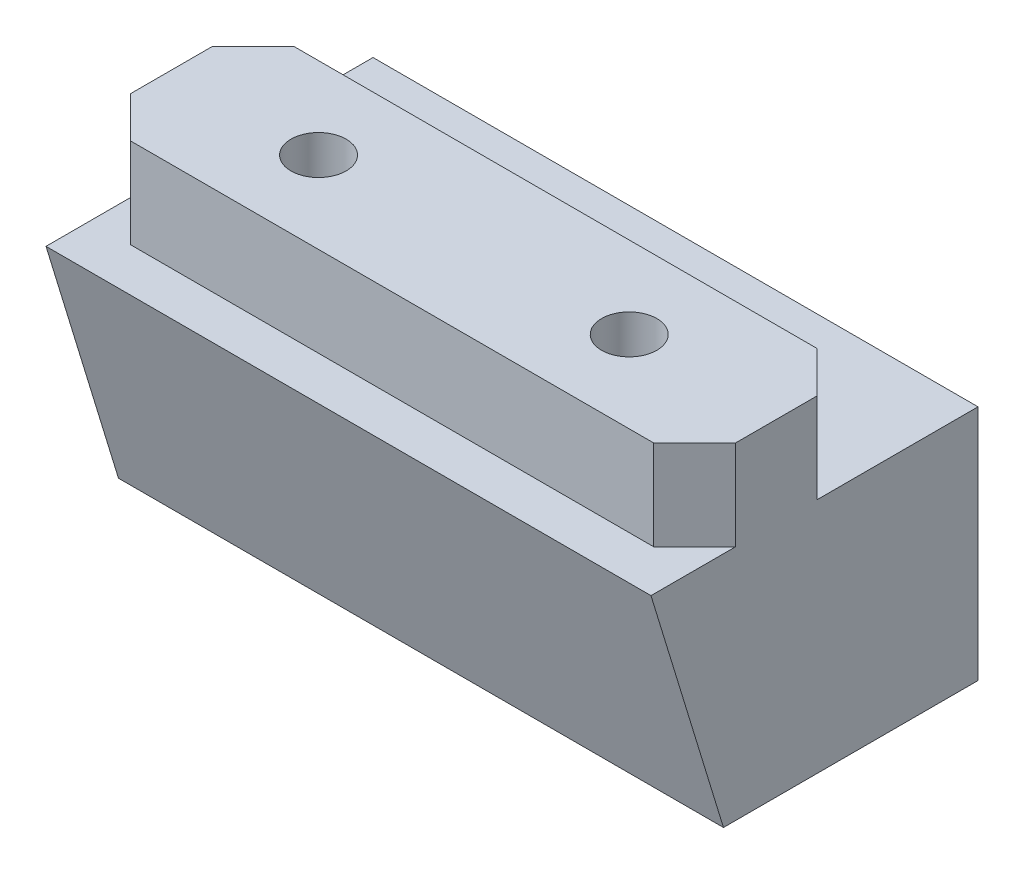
ISO-10303-21;
HEADER;
FILE_DESCRIPTION(('STEP AP214'),'2;1');
FILE_NAME('part.step','',(''),(''),'','','');
FILE_SCHEMA(('AUTOMOTIVE_DESIGN { 1 0 10303 214 1 1 1 1 }'));
ENDSEC;
DATA;
#1=APPLICATION_CONTEXT('core data for automotive mechanical design processes');
#2=APPLICATION_PROTOCOL_DEFINITION('international standard','automotive_design',2000,#1);
#3=PRODUCT_CONTEXT('',#1,'mechanical');
#4=PRODUCT('Part','Part','',(#3));
#5=PRODUCT_RELATED_PRODUCT_CATEGORY('part','',(#4));
#6=PRODUCT_DEFINITION_FORMATION('','',#4);
#7=PRODUCT_DEFINITION_CONTEXT('part definition',#1,'design');
#8=PRODUCT_DEFINITION('design','',#6,#7);
#9=PRODUCT_DEFINITION_SHAPE('','',#8);
#10=(LENGTH_UNIT() NAMED_UNIT(*) SI_UNIT(.MILLI.,.METRE.));
#11=(NAMED_UNIT(*) PLANE_ANGLE_UNIT() SI_UNIT($,.RADIAN.));
#12=(NAMED_UNIT(*) SI_UNIT($,.STERADIAN.) SOLID_ANGLE_UNIT());
#13=UNCERTAINTY_MEASURE_WITH_UNIT(LENGTH_MEASURE(1.E-05),#10,'distance_accuracy_value','');
#14=(GEOMETRIC_REPRESENTATION_CONTEXT(3) GLOBAL_UNCERTAINTY_ASSIGNED_CONTEXT((#13)) GLOBAL_UNIT_ASSIGNED_CONTEXT((#10,
#11,#12)) REPRESENTATION_CONTEXT('',''));
#15=CARTESIAN_POINT('',(0.,0.,0.));
#16=DIRECTION('',(0.,0.,1.));
#17=DIRECTION('',(1.,0.,0.));
#18=AXIS2_PLACEMENT_3D('',#15,#16,#17);
#19=CARTESIAN_POINT('',(37.,14.,-88.));
#20=DIRECTION('',(0.,1.,0.));
#21=DIRECTION('',(0.,0.,-1.));
#22=AXIS2_PLACEMENT_3D('',#19,#20,#21);
#23=PLANE('',#22);
#24=DIRECTION('',(0.,0.,-1.));
#25=VECTOR('',#24,1.);
#26=CARTESIAN_POINT('',(-37.,14.,-87.662689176));
#27=LINE('',#26,#25);
#28=CARTESIAN_POINT('',(-37.,14.,-88.000000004));
#29=VERTEX_POINT('',#28);
#30=CARTESIAN_POINT('',(-37.,14.,-107.662689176));
#31=VERTEX_POINT('',#30);
#32=EDGE_CURVE('E202',#29,#31,#27,.T.);
#33=ORIENTED_EDGE('',*,*,#32,.F.);
#34=DIRECTION('',(-0.707106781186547,0.,0.707106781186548));
#35=VECTOR('',#34,1.);
#36=CARTESIAN_POINT('',(-34.5,14.,-90.5));
#37=LINE('',#36,#35);
#38=CARTESIAN_POINT('',(-31.999999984,14.,-93.0000000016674));
#39=VERTEX_POINT('',#38);
#40=EDGE_CURVE('E192',#39,#29,#37,.T.);
#41=ORIENTED_EDGE('',*,*,#40,.F.);
#42=DIRECTION('',(1.,0.,0.));
#43=VECTOR('',#42,1.);
#44=CARTESIAN_POINT('',(0.,14.,-93.));
#45=LINE('',#44,#43);
#46=CARTESIAN_POINT('',(31.999999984,14.,-93.0000000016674));
#47=VERTEX_POINT('',#46);
#48=EDGE_CURVE('E188',#39,#47,#45,.T.);
#49=ORIENTED_EDGE('',*,*,#48,.T.);
#50=DIRECTION('',(-0.707106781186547,0.,-0.707106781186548));
#51=VECTOR('',#50,1.);
#52=CARTESIAN_POINT('',(34.5,14.,-90.5));
#53=LINE('',#52,#51);
#54=CARTESIAN_POINT('',(37.,14.,-88.000000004));
#55=VERTEX_POINT('',#54);
#56=EDGE_CURVE('E155',#55,#47,#53,.T.);
#57=ORIENTED_EDGE('',*,*,#56,.F.);
#58=DIRECTION('',(0.,0.,1.));
#59=VECTOR('',#58,1.);
#60=CARTESIAN_POINT('',(37.,14.,-87.662689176));
#61=LINE('',#60,#59);
#62=CARTESIAN_POINT('',(37.,14.,-107.662689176));
#63=VERTEX_POINT('',#62);
#64=EDGE_CURVE('E134',#63,#55,#61,.T.);
#65=ORIENTED_EDGE('',*,*,#64,.F.);
#66=DIRECTION('',(1.,0.,0.));
#67=VECTOR('',#66,1.);
#68=CARTESIAN_POINT('',(0.,14.,-107.662689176));
#69=LINE('',#68,#67);
#70=EDGE_CURVE('E93',#31,#63,#69,.T.);
#71=ORIENTED_EDGE('',*,*,#70,.F.);
#72=EDGE_LOOP('',(#33,#41,#49,#57,#65,#71));
#73=FACE_BOUND('',#72,.T.);
#74=ADVANCED_FACE('F24',(#73),#23,.T.);
#75=CARTESIAN_POINT('',(-37.,14.,-107.662689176));
#76=DIRECTION('',(0.,0.,-1.));
#77=DIRECTION('',(1.,0.,0.));
#78=AXIS2_PLACEMENT_3D('',#75,#76,#77);
#79=PLANE('',#78);
#80=ORIENTED_EDGE('',*,*,#70,.T.);
#81=DIRECTION('',(0.,1.,0.));
#82=VECTOR('',#81,1.);
#83=CARTESIAN_POINT('',(37.,5.,-107.662689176));
#84=LINE('',#83,#82);
#85=CARTESIAN_POINT('',(37.,-15.,-107.662689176));
#86=VERTEX_POINT('',#85);
#87=EDGE_CURVE('E151',#86,#63,#84,.T.);
#88=ORIENTED_EDGE('',*,*,#87,.F.);
#89=DIRECTION('',(-1.,0.,0.));
#90=VECTOR('',#89,1.);
#91=CARTESIAN_POINT('',(0.,-15.,-107.662689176));
#92=LINE('',#91,#90);
#93=CARTESIAN_POINT('',(-37.,-15.,-107.662689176));
#94=VERTEX_POINT('',#93);
#95=EDGE_CURVE('E141',#86,#94,#92,.T.);
#96=ORIENTED_EDGE('',*,*,#95,.T.);
#97=DIRECTION('',(0.,-1.,0.));
#98=VECTOR('',#97,1.);
#99=CARTESIAN_POINT('',(-37.,5.,-107.662689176));
#100=LINE('',#99,#98);
#101=EDGE_CURVE('E174',#31,#94,#100,.T.);
#102=ORIENTED_EDGE('',*,*,#101,.F.);
#103=EDGE_LOOP('',(#80,#88,#96,#102));
#104=FACE_BOUND('',#103,.T.);
#105=ADVANCED_FACE('F154',(#104),#79,.T.);
#106=CARTESIAN_POINT('',(37.,-15.,-76.528878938));
#107=DIRECTION('',(0.,1.,0.));
#108=DIRECTION('',(0.,0.,-1.));
#109=AXIS2_PLACEMENT_3D('',#106,#107,#108);
#110=PLANE('',#109);
#111=DIRECTION('',(0.,0.,-1.));
#112=VECTOR('',#111,1.);
#113=CARTESIAN_POINT('',(37.,-15.,-87.662689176));
#114=LINE('',#113,#112);
#115=CARTESIAN_POINT('',(37.,-15.,-76.528878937));
#116=VERTEX_POINT('',#115);
#117=EDGE_CURVE('E145',#116,#86,#114,.T.);
#118=ORIENTED_EDGE('',*,*,#117,.F.);
#119=DIRECTION('',(1.,0.,0.));
#120=VECTOR('',#119,1.);
#121=CARTESIAN_POINT('',(0.,-15.,-76.528878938));
#122=LINE('',#121,#120);
#123=CARTESIAN_POINT('',(-37.,-15.,-76.528878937));
#124=VERTEX_POINT('',#123);
#125=EDGE_CURVE('E147',#124,#116,#122,.T.);
#126=ORIENTED_EDGE('',*,*,#125,.F.);
#127=DIRECTION('',(0.,0.,1.));
#128=VECTOR('',#127,1.);
#129=CARTESIAN_POINT('',(-37.,-15.,-87.662689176));
#130=LINE('',#129,#128);
#131=EDGE_CURVE('E146',#94,#124,#130,.T.);
#132=ORIENTED_EDGE('',*,*,#131,.F.);
#133=ORIENTED_EDGE('',*,*,#95,.F.);
#134=EDGE_LOOP('',(#118,#126,#132,#133));
#135=FACE_BOUND('',#134,.T.);
#136=ADVANCED_FACE('F143',(#135),#110,.F.);
#137=CARTESIAN_POINT('',(37.,14.,-67.662689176));
#138=DIRECTION('',(0.,-0.292371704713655,0.956304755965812));
#139=DIRECTION('',(-1.,0.,0.));
#140=AXIS2_PLACEMENT_3D('',#137,#138,#139);
#141=PLANE('',#140);
#142=DIRECTION('',(0.,-0.956304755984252,-0.29237170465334));
#143=VECTOR('',#142,1.);
#144=CARTESIAN_POINT('',(37.,14.,-67.662689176));
#145=LINE('',#144,#143);
#146=CARTESIAN_POINT('',(37.,14.,-67.662689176));
#147=VERTEX_POINT('',#146);
#148=EDGE_CURVE('E28',#147,#116,#145,.T.);
#149=ORIENTED_EDGE('',*,*,#148,.F.);
#150=DIRECTION('',(1.,0.,0.));
#151=VECTOR('',#150,1.);
#152=CARTESIAN_POINT('',(0.,14.,-67.662689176));
#153=LINE('',#152,#151);
#154=CARTESIAN_POINT('',(-37.,14.,-67.662689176));
#155=VERTEX_POINT('',#154);
#156=EDGE_CURVE('E83',#155,#147,#153,.T.);
#157=ORIENTED_EDGE('',*,*,#156,.F.);
#158=DIRECTION('',(0.,0.956304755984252,0.29237170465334));
#159=VECTOR('',#158,1.);
#160=CARTESIAN_POINT('',(-37.,-15.,-76.528878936));
#161=LINE('',#160,#159);
#162=EDGE_CURVE('E173',#124,#155,#161,.T.);
#163=ORIENTED_EDGE('',*,*,#162,.F.);
#164=ORIENTED_EDGE('',*,*,#125,.T.);
#165=EDGE_LOOP('',(#149,#157,#163,#164));
#166=FACE_BOUND('',#165,.T.);
#167=ADVANCED_FACE('F222',(#166),#141,.T.);
#168=CARTESIAN_POINT('',(37.,14.,-67.662689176));
#169=DIRECTION('',(0.,1.,0.));
#170=DIRECTION('',(0.,0.,-1.));
#171=AXIS2_PLACEMENT_3D('',#168,#169,#170);
#172=PLANE('',#171);
#173=DIRECTION('',(0.707106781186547,0.,0.707106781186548));
#174=VECTOR('',#173,1.);
#175=CARTESIAN_POINT('',(-34.5,14.,-75.5));
#176=LINE('',#175,#174);
#177=CARTESIAN_POINT('',(-37.,14.,-78.000000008));
#178=VERTEX_POINT('',#177);
#179=CARTESIAN_POINT('',(-31.999999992,14.,-72.9999999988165));
#180=VERTEX_POINT('',#179);
#181=EDGE_CURVE('E207',#178,#180,#176,.T.);
#182=ORIENTED_EDGE('',*,*,#181,.F.);
#183=DIRECTION('',(0.,0.,-1.));
#184=VECTOR('',#183,1.);
#185=CARTESIAN_POINT('',(-37.,14.,-87.662689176));
#186=LINE('',#185,#184);
#187=EDGE_CURVE('E175',#155,#178,#186,.T.);
#188=ORIENTED_EDGE('',*,*,#187,.F.);
#189=ORIENTED_EDGE('',*,*,#156,.T.);
#190=DIRECTION('',(0.,0.,1.));
#191=VECTOR('',#190,1.);
#192=CARTESIAN_POINT('',(37.,14.,-87.662689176));
#193=LINE('',#192,#191);
#194=CARTESIAN_POINT('',(37.,14.,-78.000000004));
#195=VERTEX_POINT('',#194);
#196=EDGE_CURVE('E162',#195,#147,#193,.T.);
#197=ORIENTED_EDGE('',*,*,#196,.F.);
#198=DIRECTION('',(0.707106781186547,0.,-0.707106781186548));
#199=VECTOR('',#198,1.);
#200=CARTESIAN_POINT('',(34.5,14.,-75.5));
#201=LINE('',#200,#199);
#202=CARTESIAN_POINT('',(31.999999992,14.,-72.9999999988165));
#203=VERTEX_POINT('',#202);
#204=EDGE_CURVE('E107',#203,#195,#201,.T.);
#205=ORIENTED_EDGE('',*,*,#204,.F.);
#206=DIRECTION('',(-1.,0.,0.));
#207=VECTOR('',#206,1.);
#208=CARTESIAN_POINT('',(0.,14.,-73.));
#209=LINE('',#208,#207);
#210=EDGE_CURVE('E183',#203,#180,#209,.T.);
#211=ORIENTED_EDGE('',*,*,#210,.T.);
#212=EDGE_LOOP('',(#182,#188,#189,#197,#205,#211));
#213=FACE_BOUND('',#212,.T.);
#214=ADVANCED_FACE('F224',(#213),#172,.T.);
#215=CARTESIAN_POINT('',(-19.,-0.639156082,-83.));
#216=DIRECTION('',(0.,1.,0.));
#217=DIRECTION('',(0.,0.,1.));
#218=AXIS2_PLACEMENT_3D('',#215,#216,#217);
#219=CONICAL_SURFACE('',#218,0.,1.04719755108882);
#220=CARTESIAN_POINT('',(-19.,-0.639156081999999,-83.));
#221=VERTEX_POINT('',#220);
#222=VERTEX_LOOP('',#221);
#223=FACE_BOUND('',#222,.T.);
#224=CARTESIAN_POINT('',(-19.,1.30940107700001,-83.));
#225=DIRECTION('',(0.,1.,0.));
#226=DIRECTION('',(-1.,0.,0.));
#227=AXIS2_PLACEMENT_3D('',#224,#225,#226);
#228=CIRCLE('',#227,3.375);
#229=CARTESIAN_POINT('',(-22.375,1.309401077,-83.));
#230=VERTEX_POINT('',#229);
#231=EDGE_CURVE('E163',#230,#230,#228,.F.);
#232=ORIENTED_EDGE('',*,*,#231,.F.);
#233=EDGE_LOOP('',(#232));
#234=FACE_BOUND('',#233,.T.);
#235=ADVANCED_FACE('F286',(#223,#234),#219,.F.);
#236=CARTESIAN_POINT('',(37.,-15.,-107.662689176));
#237=DIRECTION('',(1.,0.,0.));
#238=DIRECTION('',(0.,1.,0.));
#239=AXIS2_PLACEMENT_3D('',#236,#237,#238);
#240=PLANE('',#239);
#241=ORIENTED_EDGE('',*,*,#117,.T.);
#242=ORIENTED_EDGE('',*,*,#87,.T.);
#243=ORIENTED_EDGE('',*,*,#64,.T.);
#244=DIRECTION('',(0.,-1.,0.));
#245=VECTOR('',#244,1.);
#246=CARTESIAN_POINT('',(37.,19.5,-88.));
#247=LINE('',#246,#245);
#248=CARTESIAN_POINT('',(37.,25.,-88.));
#249=VERTEX_POINT('',#248);
#250=EDGE_CURVE('E157',#249,#55,#247,.T.);
#251=ORIENTED_EDGE('',*,*,#250,.F.);
#252=DIRECTION('',(0.,0.,-1.));
#253=VECTOR('',#252,1.);
#254=CARTESIAN_POINT('',(37.,25.,-83.));
#255=LINE('',#254,#253);
#256=CARTESIAN_POINT('',(37.,25.,-78.));
#257=VERTEX_POINT('',#256);
#258=EDGE_CURVE('E165',#257,#249,#255,.T.);
#259=ORIENTED_EDGE('',*,*,#258,.F.);
#260=DIRECTION('',(0.,1.,0.));
#261=VECTOR('',#260,1.);
#262=CARTESIAN_POINT('',(37.,19.5,-78.));
#263=LINE('',#262,#261);
#264=EDGE_CURVE('E166',#195,#257,#263,.T.);
#265=ORIENTED_EDGE('',*,*,#264,.F.);
#266=ORIENTED_EDGE('',*,*,#196,.T.);
#267=ORIENTED_EDGE('',*,*,#148,.T.);
#268=EDGE_LOOP('',(#241,#242,#243,#251,#259,#265,#266,#267));
#269=FACE_BOUND('',#268,.T.);
#270=ADVANCED_FACE('F150',(#269),#240,.T.);
#271=CARTESIAN_POINT('',(37.,14.,-88.));
#272=DIRECTION('',(0.707106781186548,0.,-0.707106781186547));
#273=DIRECTION('',(-0.707106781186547,0.,-0.707106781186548));
#274=AXIS2_PLACEMENT_3D('',#271,#272,#273);
#275=PLANE('',#274);
#276=DIRECTION('',(-0.707106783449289,0.,-0.707106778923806));
#277=VECTOR('',#276,1.);
#278=CARTESIAN_POINT('',(37.,25.,-88.));
#279=LINE('',#278,#277);
#280=CARTESIAN_POINT('',(31.999999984,25.,-93.));
#281=VERTEX_POINT('',#280);
#282=EDGE_CURVE('E186',#249,#281,#279,.T.);
#283=ORIENTED_EDGE('',*,*,#282,.F.);
#284=ORIENTED_EDGE('',*,*,#250,.T.);
#285=ORIENTED_EDGE('',*,*,#56,.T.);
#286=DIRECTION('',(0.,1.,0.));
#287=VECTOR('',#286,1.);
#288=CARTESIAN_POINT('',(32.,19.5,-93.));
#289=LINE('',#288,#287);
#290=EDGE_CURVE('E189',#47,#281,#289,.T.);
#291=ORIENTED_EDGE('',*,*,#290,.T.);
#292=EDGE_LOOP('',(#283,#284,#285,#291));
#293=FACE_BOUND('',#292,.T.);
#294=ADVANCED_FACE('F252',(#293),#275,.T.);
#295=CARTESIAN_POINT('',(-32.,14.,-93.));
#296=DIRECTION('',(0.,0.,1.));
#297=DIRECTION('',(1.,0.,0.));
#298=AXIS2_PLACEMENT_3D('',#295,#296,#297);
#299=PLANE('',#298);
#300=ORIENTED_EDGE('',*,*,#290,.F.);
#301=ORIENTED_EDGE('',*,*,#48,.F.);
#302=DIRECTION('',(0.,-1.,0.));
#303=VECTOR('',#302,1.);
#304=CARTESIAN_POINT('',(-32.,19.5,-93.));
#305=LINE('',#304,#303);
#306=CARTESIAN_POINT('',(-31.999999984,25.,-93.));
#307=VERTEX_POINT('',#306);
#308=EDGE_CURVE('E196',#307,#39,#305,.T.);
#309=ORIENTED_EDGE('',*,*,#308,.F.);
#310=DIRECTION('',(-1.,0.,0.));
#311=VECTOR('',#310,1.);
#312=CARTESIAN_POINT('',(0.,25.,-93.));
#313=LINE('',#312,#311);
#314=EDGE_CURVE('E193',#281,#307,#313,.T.);
#315=ORIENTED_EDGE('',*,*,#314,.F.);
#316=EDGE_LOOP('',(#300,#301,#309,#315));
#317=FACE_BOUND('',#316,.T.);
#318=ADVANCED_FACE('F242',(#317),#299,.F.);
#319=CARTESIAN_POINT('',(-32.,14.,-93.));
#320=DIRECTION('',(-0.707106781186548,0.,-0.707106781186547));
#321=DIRECTION('',(-0.707106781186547,0.,0.707106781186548));
#322=AXIS2_PLACEMENT_3D('',#319,#320,#321);
#323=PLANE('',#322);
#324=DIRECTION('',(-0.707106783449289,0.,0.707106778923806));
#325=VECTOR('',#324,1.);
#326=CARTESIAN_POINT('',(-31.999999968,25.,-93.));
#327=LINE('',#326,#325);
#328=CARTESIAN_POINT('',(-37.,25.,-88.000000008));
#329=VERTEX_POINT('',#328);
#330=EDGE_CURVE('E195',#307,#329,#327,.T.);
#331=ORIENTED_EDGE('',*,*,#330,.F.);
#332=ORIENTED_EDGE('',*,*,#308,.T.);
#333=ORIENTED_EDGE('',*,*,#40,.T.);
#334=DIRECTION('',(0.,-1.,0.));
#335=VECTOR('',#334,1.);
#336=CARTESIAN_POINT('',(-37.,5.,-88.000000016));
#337=LINE('',#336,#335);
#338=EDGE_CURVE('E199',#329,#29,#337,.T.);
#339=ORIENTED_EDGE('',*,*,#338,.F.);
#340=EDGE_LOOP('',(#331,#332,#333,#339));
#341=FACE_BOUND('',#340,.T.);
#342=ADVANCED_FACE('F246',(#341),#323,.T.);
#343=CARTESIAN_POINT('',(-37.,25.,-107.662689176));
#344=DIRECTION('',(-1.,0.,0.));
#345=DIRECTION('',(0.,-1.,0.));
#346=AXIS2_PLACEMENT_3D('',#343,#344,#345);
#347=PLANE('',#346);
#348=ORIENTED_EDGE('',*,*,#187,.T.);
#349=DIRECTION('',(0.,-1.,0.));
#350=VECTOR('',#349,1.);
#351=CARTESIAN_POINT('',(-37.,19.5,-78.));
#352=LINE('',#351,#350);
#353=CARTESIAN_POINT('',(-37.,25.,-78.));
#354=VERTEX_POINT('',#353);
#355=EDGE_CURVE('E177',#354,#178,#352,.T.);
#356=ORIENTED_EDGE('',*,*,#355,.F.);
#357=DIRECTION('',(0.,0.,1.));
#358=VECTOR('',#357,1.);
#359=CARTESIAN_POINT('',(-37.,25.,-83.));
#360=LINE('',#359,#358);
#361=EDGE_CURVE('E203',#329,#354,#360,.T.);
#362=ORIENTED_EDGE('',*,*,#361,.F.);
#363=ORIENTED_EDGE('',*,*,#338,.T.);
#364=ORIENTED_EDGE('',*,*,#32,.T.);
#365=ORIENTED_EDGE('',*,*,#101,.T.);
#366=ORIENTED_EDGE('',*,*,#131,.T.);
#367=ORIENTED_EDGE('',*,*,#162,.T.);
#368=EDGE_LOOP('',(#348,#356,#362,#363,#364,#365,#366,#367));
#369=FACE_BOUND('',#368,.T.);
#370=ADVANCED_FACE('F219',(#369),#347,.T.);
#371=CARTESIAN_POINT('',(-32.,14.,-73.));
#372=DIRECTION('',(-0.707106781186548,0.,0.707106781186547));
#373=DIRECTION('',(0.,1.,0.));
#374=AXIS2_PLACEMENT_3D('',#371,#372,#373);
#375=PLANE('',#374);
#376=ORIENTED_EDGE('',*,*,#181,.T.);
#377=DIRECTION('',(0.,1.,0.));
#378=VECTOR('',#377,1.);
#379=CARTESIAN_POINT('',(-32.,19.5,-73.));
#380=LINE('',#379,#378);
#381=CARTESIAN_POINT('',(-31.999999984,25.,-73.));
#382=VERTEX_POINT('',#381);
#383=EDGE_CURVE('E208',#180,#382,#380,.T.);
#384=ORIENTED_EDGE('',*,*,#383,.T.);
#385=DIRECTION('',(0.70710678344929,0.,0.707106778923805));
#386=VECTOR('',#385,1.);
#387=CARTESIAN_POINT('',(-37.,25.,-78.));
#388=LINE('',#387,#386);
#389=EDGE_CURVE('E180',#354,#382,#388,.T.);
#390=ORIENTED_EDGE('',*,*,#389,.F.);
#391=ORIENTED_EDGE('',*,*,#355,.T.);
#392=EDGE_LOOP('',(#376,#384,#390,#391));
#393=FACE_BOUND('',#392,.T.);
#394=ADVANCED_FACE('F313',(#393),#375,.T.);
#395=CARTESIAN_POINT('',(32.,25.,-73.));
#396=DIRECTION('',(0.,0.,-1.));
#397=DIRECTION('',(0.,-1.,0.));
#398=AXIS2_PLACEMENT_3D('',#395,#396,#397);
#399=PLANE('',#398);
#400=DIRECTION('',(0.,-1.,0.));
#401=VECTOR('',#400,1.);
#402=CARTESIAN_POINT('',(32.,19.5,-73.));
#403=LINE('',#402,#401);
#404=CARTESIAN_POINT('',(31.999999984,25.,-73.));
#405=VERTEX_POINT('',#404);
#406=EDGE_CURVE('E181',#405,#203,#403,.T.);
#407=ORIENTED_EDGE('',*,*,#406,.F.);
#408=DIRECTION('',(1.,0.,0.));
#409=VECTOR('',#408,1.);
#410=CARTESIAN_POINT('',(0.,25.,-73.));
#411=LINE('',#410,#409);
#412=EDGE_CURVE('E43',#382,#405,#411,.T.);
#413=ORIENTED_EDGE('',*,*,#412,.F.);
#414=ORIENTED_EDGE('',*,*,#383,.F.);
#415=ORIENTED_EDGE('',*,*,#210,.F.);
#416=EDGE_LOOP('',(#407,#413,#414,#415));
#417=FACE_BOUND('',#416,.T.);
#418=ADVANCED_FACE('F316',(#417),#399,.F.);
#419=CARTESIAN_POINT('',(37.,14.,-78.));
#420=DIRECTION('',(0.707106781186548,0.,0.707106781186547));
#421=DIRECTION('',(0.,1.,0.));
#422=AXIS2_PLACEMENT_3D('',#419,#420,#421);
#423=PLANE('',#422);
#424=ORIENTED_EDGE('',*,*,#204,.T.);
#425=ORIENTED_EDGE('',*,*,#264,.T.);
#426=DIRECTION('',(0.707106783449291,0.,-0.707106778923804));
#427=VECTOR('',#426,1.);
#428=CARTESIAN_POINT('',(31.999999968,25.,-73.));
#429=LINE('',#428,#427);
#430=EDGE_CURVE('E179',#405,#257,#429,.T.);
#431=ORIENTED_EDGE('',*,*,#430,.F.);
#432=ORIENTED_EDGE('',*,*,#406,.T.);
#433=EDGE_LOOP('',(#424,#425,#431,#432));
#434=FACE_BOUND('',#433,.T.);
#435=ADVANCED_FACE('F255',(#434),#423,.T.);
#436=CARTESIAN_POINT('',(-19.,1.309401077,-83.));
#437=DIRECTION('',(0.,1.,0.));
#438=DIRECTION('',(0.,0.,1.));
#439=AXIS2_PLACEMENT_3D('',#436,#437,#438);
#440=CYLINDRICAL_SURFACE('',#439,3.375);
#441=CARTESIAN_POINT('',(-19.,25.,-83.));
#442=DIRECTION('',(0.,1.,0.));
#443=DIRECTION('',(0.,0.,1.));
#444=AXIS2_PLACEMENT_3D('',#441,#442,#443);
#445=CIRCLE('',#444,3.375);
#446=CARTESIAN_POINT('',(-19.,25.,-79.625));
#447=VERTEX_POINT('',#446);
#448=EDGE_CURVE('E211',#447,#447,#445,.F.);
#449=ORIENTED_EDGE('',*,*,#448,.F.);
#450=EDGE_LOOP('',(#449));
#451=FACE_BOUND('',#450,.T.);
#452=ORIENTED_EDGE('',*,*,#231,.T.);
#453=EDGE_LOOP('',(#452));
#454=FACE_BOUND('',#453,.T.);
#455=ADVANCED_FACE('F265',(#451,#454),#440,.F.);
#456=CARTESIAN_POINT('',(19.,-0.639156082,-83.));
#457=DIRECTION('',(0.,1.,0.));
#458=DIRECTION('',(0.,0.,1.));
#459=AXIS2_PLACEMENT_3D('',#456,#457,#458);
#460=CONICAL_SURFACE('',#459,0.,1.04719755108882);
#461=CARTESIAN_POINT('',(19.,-0.639156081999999,-83.));
#462=VERTEX_POINT('',#461);
#463=VERTEX_LOOP('',#462);
#464=FACE_BOUND('',#463,.T.);
#465=CARTESIAN_POINT('',(19.,1.30940107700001,-83.));
#466=DIRECTION('',(0.,1.,0.));
#467=DIRECTION('',(-1.,0.,0.));
#468=AXIS2_PLACEMENT_3D('',#465,#466,#467);
#469=CIRCLE('',#468,3.375);
#470=CARTESIAN_POINT('',(15.625,1.309401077,-83.));
#471=VERTEX_POINT('',#470);
#472=EDGE_CURVE('E34',#471,#471,#469,.F.);
#473=ORIENTED_EDGE('',*,*,#472,.F.);
#474=EDGE_LOOP('',(#473));
#475=FACE_BOUND('',#474,.T.);
#476=ADVANCED_FACE('F263',(#464,#475),#460,.F.);
#477=CARTESIAN_POINT('',(37.,25.,-73.));
#478=DIRECTION('',(0.,1.,0.));
#479=DIRECTION('',(0.,0.,-1.));
#480=AXIS2_PLACEMENT_3D('',#477,#478,#479);
#481=PLANE('',#480);
#482=CARTESIAN_POINT('',(19.,25.,-83.));
#483=DIRECTION('',(0.,1.,0.));
#484=DIRECTION('',(0.,0.,1.));
#485=AXIS2_PLACEMENT_3D('',#482,#483,#484);
#486=CIRCLE('',#485,3.375);
#487=CARTESIAN_POINT('',(19.,25.,-79.625));
#488=VERTEX_POINT('',#487);
#489=EDGE_CURVE('E13',#488,#488,#486,.T.);
#490=ORIENTED_EDGE('',*,*,#489,.F.);
#491=EDGE_LOOP('',(#490));
#492=FACE_BOUND('',#491,.T.);
#493=ORIENTED_EDGE('',*,*,#448,.T.);
#494=EDGE_LOOP('',(#493));
#495=FACE_BOUND('',#494,.T.);
#496=ORIENTED_EDGE('',*,*,#412,.T.);
#497=ORIENTED_EDGE('',*,*,#430,.T.);
#498=ORIENTED_EDGE('',*,*,#258,.T.);
#499=ORIENTED_EDGE('',*,*,#282,.T.);
#500=ORIENTED_EDGE('',*,*,#314,.T.);
#501=ORIENTED_EDGE('',*,*,#330,.T.);
#502=ORIENTED_EDGE('',*,*,#361,.T.);
#503=ORIENTED_EDGE('',*,*,#389,.T.);
#504=EDGE_LOOP('',(#496,#497,#498,#499,#500,#501,#502,#503));
#505=FACE_BOUND('',#504,.T.);
#506=ADVANCED_FACE('F26',(#492,#495,#505),#481,.T.);
#507=CARTESIAN_POINT('',(19.,1.309401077,-83.));
#508=DIRECTION('',(0.,1.,0.));
#509=DIRECTION('',(0.,0.,1.));
#510=AXIS2_PLACEMENT_3D('',#507,#508,#509);
#511=CYLINDRICAL_SURFACE('',#510,3.375);
#512=ORIENTED_EDGE('',*,*,#489,.T.);
#513=EDGE_LOOP('',(#512));
#514=FACE_BOUND('',#513,.T.);
#515=ORIENTED_EDGE('',*,*,#472,.T.);
#516=EDGE_LOOP('',(#515));
#517=FACE_BOUND('',#516,.T.);
#518=ADVANCED_FACE('F261',(#514,#517),#511,.F.);
#519=CLOSED_SHELL('',(#74,#105,#136,#167,#214,#235,#270,#294,#318,#342,#370,#394,#418,#435,#455,
#476,#506,#518));
#520=MANIFOLD_SOLID_BREP('B1',#519);
#521=ADVANCED_BREP_SHAPE_REPRESENTATION('',(#18,#520),#14);
#522=SHAPE_DEFINITION_REPRESENTATION(#9,#521);
ENDSEC;
END-ISO-10303-21;
